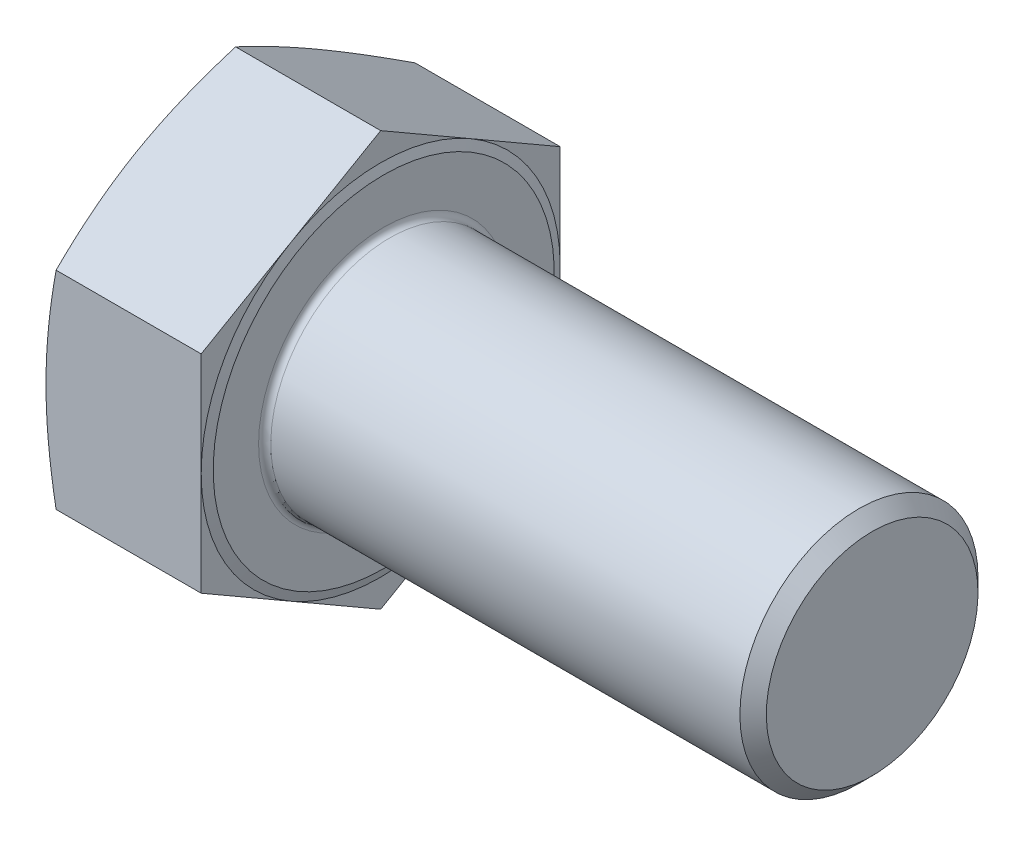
from build123d import *

# Parameters (mm, degrees)
BASEHEAD_DEPTH = 25.42
SKETCH3_R      = 19.5
BASEBODY_DEPTH = 80
CHAMFER1_SIZE  = 2.165
HEADFILLET_R   = 1


with BuildPart() as part:
    # Sketch-BaseHead → BaseHead (new body)
    with BuildSketch(Plane(origin=(0, 0, 0), x_dir=(0, 0, -1), z_dir=(1, 0, 0))):
        Polygon((0, -33.948195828), (29.4, -16.974097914), (29.4, 16.974097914), (0, 33.948195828), (-29.4, 16.974097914), (-29.4, -16.974097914), align=None)
    extrude(amount=BASEHEAD_DEPTH)

    # Sketch4 → HeadChamfer (revolve, cut)
    with BuildSketch(Plane(origin=(-0.264637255, -5.916896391, 0), x_dir=(0, 1, 0), z_dir=(0, 0, 1))):
        Polygon((39.865092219, -0.264637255), (35.316896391, -0.264637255), (39.865092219, -1.920045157), align=None)
    revolve(axis=Axis((-4.001564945, 0, 0), (1, 0, 0)), mode=Mode.SUBTRACT)

    # Sketch1 → Revolve1 (revolve)
    with BuildSketch(Plane(origin=(0, 0, 0), x_dir=(1, 0, 0), z_dir=(0, 1, 0)), mode=Mode.PRIVATE) as revolve1_sk:
        Polygon((25.42, 0), (25.92, 0), (25.92, 27.93), (25.42, 29.4), align=None)
    revolve(revolve1_sk.sketch.rotate(Axis((-4.001564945, 0, 0), (1, 0, 0)), 270), axis=Axis((-4.001564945, 0, 0), (1, 0, 0)))

    # Sketch3 → BaseBody (add)
    with BuildSketch(Plane(origin=(25.92, 0, 0), x_dir=(0, 0, -1), z_dir=(1, 0, 0))):
        with Locations(Location((0, 0, 0), (0, 0, 270))):
            Circle(SKETCH3_R)
    extrude(amount=BASEBODY_DEPTH)

    # Chamfer1
    chamfer1_edges = [part.edges().sort_by_distance(p)[0] for p in [
        (105.92, 19.5, 0),
    ]]
    chamfer(chamfer1_edges, length=CHAMFER1_SIZE)

    # HeadFillet
    headfillet_edges = [part.edges().sort_by_distance(p)[0] for p in [
        (25.92, 19.5, 0),
    ]]
    fillet(headfillet_edges, radius=HEADFILLET_R)


solid = part.part
